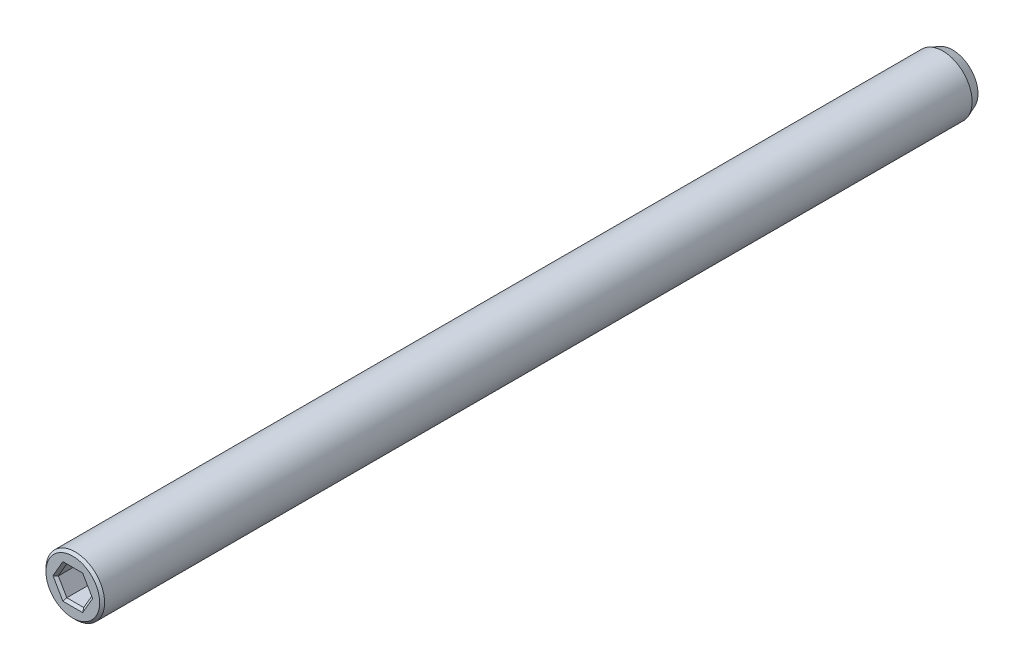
ISO-10303-21;
HEADER;
FILE_DESCRIPTION(('STEP AP214'),'2;1');
FILE_NAME('part.step','',(''),(''),'','','');
FILE_SCHEMA(('AUTOMOTIVE_DESIGN { 1 0 10303 214 1 1 1 1 }'));
ENDSEC;
DATA;
#1=APPLICATION_CONTEXT('core data for automotive mechanical design processes');
#2=APPLICATION_PROTOCOL_DEFINITION('international standard','automotive_design',2000,#1);
#3=PRODUCT_CONTEXT('',#1,'mechanical');
#4=PRODUCT('Part','Part','',(#3));
#5=PRODUCT_RELATED_PRODUCT_CATEGORY('part','',(#4));
#6=PRODUCT_DEFINITION_FORMATION('','',#4);
#7=PRODUCT_DEFINITION_CONTEXT('part definition',#1,'design');
#8=PRODUCT_DEFINITION('design','',#6,#7);
#9=PRODUCT_DEFINITION_SHAPE('','',#8);
#10=(LENGTH_UNIT() NAMED_UNIT(*) SI_UNIT(.MILLI.,.METRE.));
#11=(NAMED_UNIT(*) PLANE_ANGLE_UNIT() SI_UNIT($,.RADIAN.));
#12=(NAMED_UNIT(*) SI_UNIT($,.STERADIAN.) SOLID_ANGLE_UNIT());
#13=UNCERTAINTY_MEASURE_WITH_UNIT(LENGTH_MEASURE(1.E-05),#10,'distance_accuracy_value','');
#14=(GEOMETRIC_REPRESENTATION_CONTEXT(3) GLOBAL_UNCERTAINTY_ASSIGNED_CONTEXT((#13)) GLOBAL_UNIT_ASSIGNED_CONTEXT((#10,
#11,#12)) REPRESENTATION_CONTEXT('',''));
#15=CARTESIAN_POINT('',(0.,0.,0.));
#16=DIRECTION('',(0.,0.,1.));
#17=DIRECTION('',(1.,0.,0.));
#18=AXIS2_PLACEMENT_3D('',#15,#16,#17);
#19=CARTESIAN_POINT('',(0.,0.,-45.));
#20=DIRECTION('',(0.,0.,1.));
#21=DIRECTION('',(1.,0.,0.));
#22=AXIS2_PLACEMENT_3D('',#19,#20,#21);
#23=CYLINDRICAL_SURFACE('',#22,3.);
#24=CARTESIAN_POINT('',(0.,0.,-44.));
#25=DIRECTION('',(0.,0.,1.));
#26=DIRECTION('',(1.,0.,0.));
#27=AXIS2_PLACEMENT_3D('',#24,#25,#26);
#28=CIRCLE('',#27,3.);
#29=CARTESIAN_POINT('',(3.,0.,-44.));
#30=VERTEX_POINT('',#29);
#31=EDGE_CURVE('E39',#30,#30,#28,.T.);
#32=CARTESIAN_POINT('',(0.,0.,44.746));
#33=DIRECTION('',(0.,0.,1.));
#34=DIRECTION('',(1.,0.,0.));
#35=AXIS2_PLACEMENT_3D('',#32,#33,#34);
#36=CIRCLE('',#35,3.);
#37=CARTESIAN_POINT('',(3.,0.,44.746));
#38=VERTEX_POINT('',#37);
#39=EDGE_CURVE('E178',#38,#38,#36,.F.);
#40=CARTESIAN_POINT('',(3.,0.,-44.));
#41=CARTESIAN_POINT('',(3.,0.,-43.0755625));
#42=CARTESIAN_POINT('',(3.,0.,-42.151125));
#43=CARTESIAN_POINT('',(3.,0.,-40.30225));
#44=CARTESIAN_POINT('',(3.,0.,-39.3778125));
#45=CARTESIAN_POINT('',(3.,0.,-37.5289375));
#46=CARTESIAN_POINT('',(3.,0.,-36.6045));
#47=CARTESIAN_POINT('',(3.,0.,-34.755625));
#48=CARTESIAN_POINT('',(3.,0.,-33.8311875));
#49=CARTESIAN_POINT('',(3.,0.,-31.9823125));
#50=CARTESIAN_POINT('',(3.,0.,-31.057875));
#51=CARTESIAN_POINT('',(3.,0.,-29.209));
#52=CARTESIAN_POINT('',(3.,0.,-28.2845625));
#53=CARTESIAN_POINT('',(3.,0.,-26.4356875));
#54=CARTESIAN_POINT('',(3.,0.,-25.51125));
#55=CARTESIAN_POINT('',(3.,0.,-23.662375));
#56=CARTESIAN_POINT('',(3.,0.,-22.7379375));
#57=CARTESIAN_POINT('',(3.,0.,-20.8890625));
#58=CARTESIAN_POINT('',(3.,0.,-19.964625));
#59=CARTESIAN_POINT('',(3.,0.,-18.11575));
#60=CARTESIAN_POINT('',(3.,0.,-17.1913125));
#61=CARTESIAN_POINT('',(3.,0.,-15.3424375));
#62=CARTESIAN_POINT('',(3.,0.,-14.418));
#63=CARTESIAN_POINT('',(3.,0.,-12.569125));
#64=CARTESIAN_POINT('',(3.,0.,-11.6446875));
#65=CARTESIAN_POINT('',(3.,0.,-9.79581250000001));
#66=CARTESIAN_POINT('',(3.,0.,-8.87137500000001));
#67=CARTESIAN_POINT('',(3.,0.,-7.02250000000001));
#68=CARTESIAN_POINT('',(3.,0.,-6.09806250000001));
#69=CARTESIAN_POINT('',(3.,0.,-4.24918750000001));
#70=CARTESIAN_POINT('',(3.,0.,-3.32475000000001));
#71=CARTESIAN_POINT('',(3.,0.,-1.47587500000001));
#72=CARTESIAN_POINT('',(3.,0.,-0.551437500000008));
#73=CARTESIAN_POINT('',(3.,0.,1.29743749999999));
#74=CARTESIAN_POINT('',(3.,0.,2.22187499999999));
#75=CARTESIAN_POINT('',(3.,0.,4.07074999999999));
#76=CARTESIAN_POINT('',(3.,0.,4.99518749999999));
#77=CARTESIAN_POINT('',(3.,0.,6.84406249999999));
#78=CARTESIAN_POINT('',(3.,0.,7.76849999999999));
#79=CARTESIAN_POINT('',(3.,0.,9.61737499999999));
#80=CARTESIAN_POINT('',(3.,0.,10.5418125));
#81=CARTESIAN_POINT('',(3.,0.,12.3906875));
#82=CARTESIAN_POINT('',(3.,0.,13.315125));
#83=CARTESIAN_POINT('',(3.,0.,15.164));
#84=CARTESIAN_POINT('',(3.,0.,16.0884375));
#85=CARTESIAN_POINT('',(3.,0.,17.9373125));
#86=CARTESIAN_POINT('',(3.,0.,18.86175));
#87=CARTESIAN_POINT('',(3.,0.,20.710625));
#88=CARTESIAN_POINT('',(3.,0.,21.6350625));
#89=CARTESIAN_POINT('',(3.,0.,23.4839375));
#90=CARTESIAN_POINT('',(3.,0.,24.408375));
#91=CARTESIAN_POINT('',(3.,0.,26.25725));
#92=CARTESIAN_POINT('',(3.,0.,27.1816875));
#93=CARTESIAN_POINT('',(3.,0.,29.0305625));
#94=CARTESIAN_POINT('',(3.,0.,29.955));
#95=CARTESIAN_POINT('',(3.,0.,31.803875));
#96=CARTESIAN_POINT('',(3.,0.,32.7283125));
#97=CARTESIAN_POINT('',(3.,0.,34.5771875));
#98=CARTESIAN_POINT('',(3.,0.,35.501625));
#99=CARTESIAN_POINT('',(3.,0.,37.3505));
#100=CARTESIAN_POINT('',(3.,0.,38.2749375));
#101=CARTESIAN_POINT('',(3.,0.,40.1238125));
#102=CARTESIAN_POINT('',(3.,0.,41.04825));
#103=CARTESIAN_POINT('',(3.,0.,42.897125));
#104=CARTESIAN_POINT('',(3.,0.,43.8215625));
#105=CARTESIAN_POINT('',(3.,0.,44.746));
#106=B_SPLINE_CURVE_WITH_KNOTS('',3,(#40,#41,#42,#43,#44,#45,#46,#47,#48,#49,#50,#51,#52,#53,
#54,#55,#56,#57,#58,#59,#60,#61,#62,#63,#64,#65,#66,#67,#68,#69,#70,#71,#72,#73,#74,#75,#76,#77,
#78,#79,#80,#81,#82,#83,#84,#85,#86,#87,#88,#89,#90,#91,#92,#93,#94,#95,#96,#97,#98,#99,#100,
#101,#102,#103,#104,#105),.UNSPECIFIED.,.F.,.F.,(4,2,2,2,2,2,2,2,2,2,2,2,2,2,2,2,2,2,2,2,2,2,2,
2,2,2,2,2,2,2,2,2,4),(0.,2.7733125,5.546625,8.3199375,11.09325,13.8665625,16.639875,19.4131875,
22.1865,24.9598125,27.733125,30.5064375,33.27975,36.0530625,38.826375,41.5996875,44.373,
47.1463125,49.919625,52.6929375,55.46625,58.2395625,61.012875,63.7861875,66.5595,69.3328125,
72.106125,74.8794375,77.65275,80.4260625,83.199375,85.9726875,88.746),.UNSPECIFIED.);
#107=EDGE_CURVE('BSEAM32',#30,#38,#106,.T.);
#108=ORIENTED_EDGE('',*,*,#31,.T.);
#109=ORIENTED_EDGE('',*,*,#39,.T.);
#110=ORIENTED_EDGE('',*,*,#107,.T.);
#111=ORIENTED_EDGE('',*,*,#107,.F.);
#112=EDGE_LOOP('',(#108,#110,#109,#111));
#113=FACE_BOUND('',#112,.T.);
#114=ADVANCED_FACE('F32',(#113),#23,.T.);
#115=CARTESIAN_POINT('',(0.,0.,-45.));
#116=DIRECTION('',(0.,0.,1.));
#117=DIRECTION('',(1.,0.,0.));
#118=AXIS2_PLACEMENT_3D('',#115,#116,#117);
#119=PLANE('',#118);
#120=CARTESIAN_POINT('',(0.,0.,-45.));
#121=DIRECTION('',(0.,0.,1.));
#122=DIRECTION('',(1.,0.,0.));
#123=AXIS2_PLACEMENT_3D('',#120,#121,#122);
#124=CIRCLE('',#123,2.6);
#125=CARTESIAN_POINT('',(2.6,0.,-45.));
#126=VERTEX_POINT('',#125);
#127=EDGE_CURVE('E11',#126,#126,#124,.F.);
#128=ORIENTED_EDGE('',*,*,#127,.T.);
#129=EDGE_LOOP('',(#128));
#130=FACE_BOUND('',#129,.T.);
#131=ADVANCED_FACE('F198',(#130),#119,.F.);
#132=CARTESIAN_POINT('',(0.,0.,45.));
#133=DIRECTION('',(0.,0.,1.));
#134=DIRECTION('',(1.,0.,0.));
#135=AXIS2_PLACEMENT_3D('',#132,#133,#134);
#136=PLANE('',#135);
#137=DIRECTION('',(1.,0.,0.));
#138=VECTOR('',#137,1.);
#139=CARTESIAN_POINT('',(0.866025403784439,1.754,45.));
#140=LINE('',#139,#138);
#141=CARTESIAN_POINT('',(-1.0126723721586,1.754,45.));
#142=VERTEX_POINT('',#141);
#143=CARTESIAN_POINT('',(1.0126723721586,1.754,45.));
#144=VERTEX_POINT('',#143);
#145=EDGE_CURVE('E166',#142,#144,#140,.T.);
#146=ORIENTED_EDGE('',*,*,#145,.T.);
#147=DIRECTION('',(0.5,-0.866025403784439,0.));
#148=VECTOR('',#147,1.);
#149=CARTESIAN_POINT('',(1.95202126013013,0.127,45.));
#150=LINE('',#149,#148);
#151=CARTESIAN_POINT('',(2.02534474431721,0.,45.));
#152=VERTEX_POINT('',#151);
#153=EDGE_CURVE('E168',#144,#152,#150,.T.);
#154=ORIENTED_EDGE('',*,*,#153,.T.);
#155=DIRECTION('',(-0.5,-0.866025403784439,0.));
#156=VECTOR('',#155,1.);
#157=CARTESIAN_POINT('',(1.08599585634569,-1.627,45.));
#158=LINE('',#157,#156);
#159=CARTESIAN_POINT('',(1.0126723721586,-1.754,45.));
#160=VERTEX_POINT('',#159);
#161=EDGE_CURVE('E158',#152,#160,#158,.T.);
#162=ORIENTED_EDGE('',*,*,#161,.T.);
#163=DIRECTION('',(-1.,0.,0.));
#164=VECTOR('',#163,1.);
#165=CARTESIAN_POINT('',(-0.866025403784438,-1.754,45.));
#166=LINE('',#165,#164);
#167=CARTESIAN_POINT('',(-1.0126723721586,-1.754,45.));
#168=VERTEX_POINT('',#167);
#169=EDGE_CURVE('E160',#160,#168,#166,.T.);
#170=ORIENTED_EDGE('',*,*,#169,.T.);
#171=DIRECTION('',(-0.5,0.866025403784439,0.));
#172=VECTOR('',#171,1.);
#173=CARTESIAN_POINT('',(-1.95202126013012,-0.127000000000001,45.));
#174=LINE('',#173,#172);
#175=CARTESIAN_POINT('',(-2.02534474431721,0.,45.));
#176=VERTEX_POINT('',#175);
#177=EDGE_CURVE('E162',#168,#176,#174,.T.);
#178=ORIENTED_EDGE('',*,*,#177,.T.);
#179=DIRECTION('',(0.5,0.866025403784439,0.));
#180=VECTOR('',#179,1.);
#181=CARTESIAN_POINT('',(-1.08599585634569,1.627,45.));
#182=LINE('',#181,#180);
#183=EDGE_CURVE('E164',#176,#142,#182,.T.);
#184=ORIENTED_EDGE('',*,*,#183,.T.);
#185=EDGE_LOOP('',(#146,#154,#162,#170,#178,#184));
#186=FACE_BOUND('',#185,.T.);
#187=CARTESIAN_POINT('',(0.,0.,45.));
#188=DIRECTION('',(0.,0.,1.));
#189=DIRECTION('',(1.,0.,0.));
#190=AXIS2_PLACEMENT_3D('',#187,#188,#189);
#191=CIRCLE('',#190,2.74599999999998);
#192=CARTESIAN_POINT('',(2.74599999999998,0.,45.));
#193=VERTEX_POINT('',#192);
#194=EDGE_CURVE('E155',#193,#193,#191,.T.);
#195=ORIENTED_EDGE('',*,*,#194,.T.);
#196=EDGE_LOOP('',(#195));
#197=FACE_BOUND('',#196,.T.);
#198=ADVANCED_FACE('F202',(#186,#197),#136,.T.);
#199=CARTESIAN_POINT('',(0.866025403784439,-1.5,42.));
#200=DIRECTION('',(0.866025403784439,-0.5,0.));
#201=DIRECTION('',(0.5,0.866025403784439,0.));
#202=AXIS2_PLACEMENT_3D('',#199,#200,#201);
#203=PLANE('',#202);
#204=DIRECTION('',(0.,0.,1.));
#205=VECTOR('',#204,1.);
#206=CARTESIAN_POINT('',(0.866025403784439,-1.5,42.));
#207=LINE('',#206,#205);
#208=CARTESIAN_POINT('',(0.866025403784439,-1.5,42.));
#209=VERTEX_POINT('',#208);
#210=CARTESIAN_POINT('',(0.866025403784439,-1.5,44.746));
#211=VERTEX_POINT('',#210);
#212=EDGE_CURVE('E143',#209,#211,#207,.T.);
#213=ORIENTED_EDGE('',*,*,#212,.T.);
#214=DIRECTION('',(0.5,0.866025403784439,0.));
#215=VECTOR('',#214,1.);
#216=CARTESIAN_POINT('',(1.73205080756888,0.,44.746));
#217=LINE('',#216,#215);
#218=CARTESIAN_POINT('',(1.73205080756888,0.,44.746));
#219=VERTEX_POINT('',#218);
#220=EDGE_CURVE('E110',#211,#219,#217,.T.);
#221=ORIENTED_EDGE('',*,*,#220,.T.);
#222=DIRECTION('',(0.,0.,1.));
#223=VECTOR('',#222,1.);
#224=CARTESIAN_POINT('',(1.73205080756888,0.,42.));
#225=LINE('',#224,#223);
#226=CARTESIAN_POINT('',(1.73205080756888,0.,42.));
#227=VERTEX_POINT('',#226);
#228=EDGE_CURVE('E103',#227,#219,#225,.T.);
#229=ORIENTED_EDGE('',*,*,#228,.F.);
#230=DIRECTION('',(0.5,0.866025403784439,0.));
#231=VECTOR('',#230,1.);
#232=CARTESIAN_POINT('',(0.866025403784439,-1.5,42.));
#233=LINE('',#232,#231);
#234=EDGE_CURVE('E107',#209,#227,#233,.T.);
#235=ORIENTED_EDGE('',*,*,#234,.F.);
#236=EDGE_LOOP('',(#213,#221,#229,#235));
#237=FACE_BOUND('',#236,.T.);
#238=ADVANCED_FACE('F105',(#237),#203,.F.);
#239=CARTESIAN_POINT('',(-0.866025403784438,-1.5,42.));
#240=DIRECTION('',(0.,-1.,0.));
#241=DIRECTION('',(0.,0.,-1.));
#242=AXIS2_PLACEMENT_3D('',#239,#240,#241);
#243=PLANE('',#242);
#244=DIRECTION('',(0.,0.,1.));
#245=VECTOR('',#244,1.);
#246=CARTESIAN_POINT('',(-0.866025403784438,-1.5,42.));
#247=LINE('',#246,#245);
#248=CARTESIAN_POINT('',(-0.866025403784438,-1.5,42.));
#249=VERTEX_POINT('',#248);
#250=CARTESIAN_POINT('',(-0.866025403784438,-1.5,44.746));
#251=VERTEX_POINT('',#250);
#252=EDGE_CURVE('E146',#249,#251,#247,.T.);
#253=ORIENTED_EDGE('',*,*,#252,.T.);
#254=DIRECTION('',(1.,0.,0.));
#255=VECTOR('',#254,1.);
#256=CARTESIAN_POINT('',(0.866025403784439,-1.5,44.746));
#257=LINE('',#256,#255);
#258=EDGE_CURVE('E46',#251,#211,#257,.T.);
#259=ORIENTED_EDGE('',*,*,#258,.T.);
#260=ORIENTED_EDGE('',*,*,#212,.F.);
#261=DIRECTION('',(1.,0.,0.));
#262=VECTOR('',#261,1.);
#263=CARTESIAN_POINT('',(-0.866025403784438,-1.5,42.));
#264=LINE('',#263,#262);
#265=EDGE_CURVE('E115',#249,#209,#264,.T.);
#266=ORIENTED_EDGE('',*,*,#265,.F.);
#267=EDGE_LOOP('',(#253,#259,#260,#266));
#268=FACE_BOUND('',#267,.T.);
#269=ADVANCED_FACE('F212',(#268),#243,.F.);
#270=CARTESIAN_POINT('',(-1.73205080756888,0.,42.));
#271=DIRECTION('',(-0.866025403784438,-0.5,0.));
#272=DIRECTION('',(0.5,-0.866025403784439,0.));
#273=AXIS2_PLACEMENT_3D('',#270,#271,#272);
#274=PLANE('',#273);
#275=DIRECTION('',(0.,0.,1.));
#276=VECTOR('',#275,1.);
#277=CARTESIAN_POINT('',(-1.73205080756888,0.,42.));
#278=LINE('',#277,#276);
#279=CARTESIAN_POINT('',(-1.73205080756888,0.,42.));
#280=VERTEX_POINT('',#279);
#281=CARTESIAN_POINT('',(-1.73205080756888,0.,44.746));
#282=VERTEX_POINT('',#281);
#283=EDGE_CURVE('E148',#280,#282,#278,.T.);
#284=ORIENTED_EDGE('',*,*,#283,.T.);
#285=DIRECTION('',(0.5,-0.866025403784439,0.));
#286=VECTOR('',#285,1.);
#287=CARTESIAN_POINT('',(-0.866025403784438,-1.5,44.746));
#288=LINE('',#287,#286);
#289=EDGE_CURVE('E54',#282,#251,#288,.T.);
#290=ORIENTED_EDGE('',*,*,#289,.T.);
#291=ORIENTED_EDGE('',*,*,#252,.F.);
#292=DIRECTION('',(0.5,-0.866025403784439,0.));
#293=VECTOR('',#292,1.);
#294=CARTESIAN_POINT('',(-1.73205080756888,0.,42.));
#295=LINE('',#294,#293);
#296=EDGE_CURVE('E140',#280,#249,#295,.T.);
#297=ORIENTED_EDGE('',*,*,#296,.F.);
#298=EDGE_LOOP('',(#284,#290,#291,#297));
#299=FACE_BOUND('',#298,.T.);
#300=ADVANCED_FACE('F222',(#299),#274,.F.);
#301=CARTESIAN_POINT('',(-0.866025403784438,1.5,42.));
#302=DIRECTION('',(-0.866025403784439,0.5,0.));
#303=DIRECTION('',(-0.5,-0.866025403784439,0.));
#304=AXIS2_PLACEMENT_3D('',#301,#302,#303);
#305=PLANE('',#304);
#306=DIRECTION('',(0.,0.,1.));
#307=VECTOR('',#306,1.);
#308=CARTESIAN_POINT('',(-0.866025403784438,1.5,42.));
#309=LINE('',#308,#307);
#310=CARTESIAN_POINT('',(-0.866025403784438,1.5,42.));
#311=VERTEX_POINT('',#310);
#312=CARTESIAN_POINT('',(-0.866025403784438,1.5,44.746));
#313=VERTEX_POINT('',#312);
#314=EDGE_CURVE('E150',#311,#313,#309,.T.);
#315=ORIENTED_EDGE('',*,*,#314,.T.);
#316=DIRECTION('',(-0.5,-0.866025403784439,0.));
#317=VECTOR('',#316,1.);
#318=CARTESIAN_POINT('',(-1.73205080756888,0.,44.746));
#319=LINE('',#318,#317);
#320=EDGE_CURVE('E173',#313,#282,#319,.T.);
#321=ORIENTED_EDGE('',*,*,#320,.T.);
#322=ORIENTED_EDGE('',*,*,#283,.F.);
#323=DIRECTION('',(-0.5,-0.866025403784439,0.));
#324=VECTOR('',#323,1.);
#325=CARTESIAN_POINT('',(-0.866025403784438,1.5,42.));
#326=LINE('',#325,#324);
#327=EDGE_CURVE('E137',#311,#280,#326,.T.);
#328=ORIENTED_EDGE('',*,*,#327,.F.);
#329=EDGE_LOOP('',(#315,#321,#322,#328));
#330=FACE_BOUND('',#329,.T.);
#331=ADVANCED_FACE('F218',(#330),#305,.F.);
#332=CARTESIAN_POINT('',(0.866025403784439,1.5,42.));
#333=DIRECTION('',(0.,1.,0.));
#334=DIRECTION('',(0.,0.,1.));
#335=AXIS2_PLACEMENT_3D('',#332,#333,#334);
#336=PLANE('',#335);
#337=DIRECTION('',(0.,0.,1.));
#338=VECTOR('',#337,1.);
#339=CARTESIAN_POINT('',(0.866025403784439,1.5,42.));
#340=LINE('',#339,#338);
#341=CARTESIAN_POINT('',(0.866025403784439,1.5,42.));
#342=VERTEX_POINT('',#341);
#343=CARTESIAN_POINT('',(0.866025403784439,1.5,44.746));
#344=VERTEX_POINT('',#343);
#345=EDGE_CURVE('E114',#342,#344,#340,.T.);
#346=ORIENTED_EDGE('',*,*,#345,.T.);
#347=DIRECTION('',(-1.,0.,0.));
#348=VECTOR('',#347,1.);
#349=CARTESIAN_POINT('',(-0.866025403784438,1.5,44.746));
#350=LINE('',#349,#348);
#351=EDGE_CURVE('E171',#344,#313,#350,.T.);
#352=ORIENTED_EDGE('',*,*,#351,.T.);
#353=ORIENTED_EDGE('',*,*,#314,.F.);
#354=DIRECTION('',(-1.,0.,0.));
#355=VECTOR('',#354,1.);
#356=CARTESIAN_POINT('',(0.866025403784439,1.5,42.));
#357=LINE('',#356,#355);
#358=EDGE_CURVE('E124',#342,#311,#357,.T.);
#359=ORIENTED_EDGE('',*,*,#358,.F.);
#360=EDGE_LOOP('',(#346,#352,#353,#359));
#361=FACE_BOUND('',#360,.T.);
#362=ADVANCED_FACE('F215',(#361),#336,.F.);
#363=CARTESIAN_POINT('',(1.73205080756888,0.,42.));
#364=DIRECTION('',(0.866025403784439,0.5,0.));
#365=DIRECTION('',(-0.5,0.866025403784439,0.));
#366=AXIS2_PLACEMENT_3D('',#363,#364,#365);
#367=PLANE('',#366);
#368=ORIENTED_EDGE('',*,*,#228,.T.);
#369=DIRECTION('',(-0.5,0.866025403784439,0.));
#370=VECTOR('',#369,1.);
#371=CARTESIAN_POINT('',(0.866025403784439,1.5,44.746));
#372=LINE('',#371,#370);
#373=EDGE_CURVE('E145',#219,#344,#372,.T.);
#374=ORIENTED_EDGE('',*,*,#373,.T.);
#375=ORIENTED_EDGE('',*,*,#345,.F.);
#376=DIRECTION('',(-0.5,0.866025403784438,0.));
#377=VECTOR('',#376,1.);
#378=CARTESIAN_POINT('',(1.73205080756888,0.,42.));
#379=LINE('',#378,#377);
#380=EDGE_CURVE('E118',#227,#342,#379,.T.);
#381=ORIENTED_EDGE('',*,*,#380,.F.);
#382=EDGE_LOOP('',(#368,#374,#375,#381));
#383=FACE_BOUND('',#382,.T.);
#384=ADVANCED_FACE('F119',(#383),#367,.F.);
#385=CARTESIAN_POINT('',(2.59807621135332,1.5,42.));
#386=DIRECTION('',(0.,0.,1.));
#387=DIRECTION('',(1.,0.,0.));
#388=AXIS2_PLACEMENT_3D('',#385,#386,#387);
#389=PLANE('',#388);
#390=ORIENTED_EDGE('',*,*,#234,.T.);
#391=ORIENTED_EDGE('',*,*,#380,.T.);
#392=ORIENTED_EDGE('',*,*,#358,.T.);
#393=ORIENTED_EDGE('',*,*,#327,.T.);
#394=ORIENTED_EDGE('',*,*,#296,.T.);
#395=ORIENTED_EDGE('',*,*,#265,.T.);
#396=EDGE_LOOP('',(#390,#391,#392,#393,#394,#395));
#397=FACE_BOUND('',#396,.T.);
#398=ADVANCED_FACE('F126',(#397),#389,.T.);
#399=CARTESIAN_POINT('',(-1.73205080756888,0.,44.746));
#400=DIRECTION('',(0.612372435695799,0.353553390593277,0.707106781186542));
#401=DIRECTION('',(0.75592894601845,0.,-0.654653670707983));
#402=AXIS2_PLACEMENT_3D('',#399,#400,#401);
#403=PLANE('',#402);
#404=DIRECTION('',(-0.755928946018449,0.,0.654653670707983));
#405=VECTOR('',#404,1.);
#406=CARTESIAN_POINT('',(-1.23717914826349,0.,44.3174285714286));
#407=LINE('',#406,#405);
#408=EDGE_CURVE('E132',#176,#282,#407,.F.);
#409=ORIENTED_EDGE('',*,*,#408,.F.);
#410=ORIENTED_EDGE('',*,*,#177,.F.);
#411=DIRECTION('',(-0.377964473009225,-0.654653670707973,0.654653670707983));
#412=VECTOR('',#411,1.);
#413=CARTESIAN_POINT('',(-0.618589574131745,-1.07142857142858,44.3174285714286));
#414=LINE('',#413,#412);
#415=EDGE_CURVE('E129',#251,#168,#414,.T.);
#416=ORIENTED_EDGE('',*,*,#415,.F.);
#417=ORIENTED_EDGE('',*,*,#289,.F.);
#418=EDGE_LOOP('',(#409,#410,#416,#417));
#419=FACE_BOUND('',#418,.T.);
#420=ADVANCED_FACE('F230',(#419),#403,.T.);
#421=CARTESIAN_POINT('',(-0.866025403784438,-1.5,44.746));
#422=DIRECTION('',(0.,0.707106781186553,0.707106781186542));
#423=DIRECTION('',(0.,-0.707106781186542,0.707106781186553));
#424=AXIS2_PLACEMENT_3D('',#421,#422,#423);
#425=PLANE('',#424);
#426=ORIENTED_EDGE('',*,*,#415,.T.);
#427=ORIENTED_EDGE('',*,*,#169,.F.);
#428=DIRECTION('',(0.377964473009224,-0.654653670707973,0.654653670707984));
#429=VECTOR('',#428,1.);
#430=CARTESIAN_POINT('',(0.618589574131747,-1.07142857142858,44.3174285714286));
#431=LINE('',#430,#429);
#432=EDGE_CURVE('E264',#211,#160,#431,.T.);
#433=ORIENTED_EDGE('',*,*,#432,.F.);
#434=ORIENTED_EDGE('',*,*,#258,.F.);
#435=EDGE_LOOP('',(#426,#427,#433,#434));
#436=FACE_BOUND('',#435,.T.);
#437=ADVANCED_FACE('F233',(#436),#425,.T.);
#438=CARTESIAN_POINT('',(-0.866025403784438,1.5,44.746));
#439=DIRECTION('',(0.6123724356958,-0.353553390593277,0.707106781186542));
#440=DIRECTION('',(0.755928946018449,0.,-0.654653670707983));
#441=AXIS2_PLACEMENT_3D('',#438,#439,#440);
#442=PLANE('',#441);
#443=ORIENTED_EDGE('',*,*,#408,.T.);
#444=ORIENTED_EDGE('',*,*,#320,.F.);
#445=DIRECTION('',(-0.377964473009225,0.654653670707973,0.654653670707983));
#446=VECTOR('',#445,1.);
#447=CARTESIAN_POINT('',(-0.618589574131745,1.07142857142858,44.3174285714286));
#448=LINE('',#447,#446);
#449=EDGE_CURVE('E259',#142,#313,#448,.F.);
#450=ORIENTED_EDGE('',*,*,#449,.F.);
#451=ORIENTED_EDGE('',*,*,#183,.F.);
#452=EDGE_LOOP('',(#443,#444,#450,#451));
#453=FACE_BOUND('',#452,.T.);
#454=ADVANCED_FACE('F237',(#453),#442,.T.);
#455=CARTESIAN_POINT('',(0.866025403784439,-1.5,44.746));
#456=DIRECTION('',(-0.6123724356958,0.353553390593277,0.707106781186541));
#457=DIRECTION('',(0.755928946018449,0.,0.654653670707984));
#458=AXIS2_PLACEMENT_3D('',#455,#456,#457);
#459=PLANE('',#458);
#460=ORIENTED_EDGE('',*,*,#432,.T.);
#461=ORIENTED_EDGE('',*,*,#161,.F.);
#462=DIRECTION('',(-0.755928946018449,0.,-0.654653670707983));
#463=VECTOR('',#462,1.);
#464=CARTESIAN_POINT('',(1.73205080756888,0.,44.746));
#465=LINE('',#464,#463);
#466=EDGE_CURVE('E256',#219,#152,#465,.F.);
#467=ORIENTED_EDGE('',*,*,#466,.F.);
#468=ORIENTED_EDGE('',*,*,#220,.F.);
#469=EDGE_LOOP('',(#460,#461,#467,#468));
#470=FACE_BOUND('',#469,.T.);
#471=ADVANCED_FACE('F241',(#470),#459,.T.);
#472=CARTESIAN_POINT('',(0.866025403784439,1.5,44.746));
#473=DIRECTION('',(0.,-0.707106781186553,0.707106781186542));
#474=DIRECTION('',(0.,-0.707106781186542,-0.707106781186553));
#475=AXIS2_PLACEMENT_3D('',#472,#473,#474);
#476=PLANE('',#475);
#477=ORIENTED_EDGE('',*,*,#449,.T.);
#478=ORIENTED_EDGE('',*,*,#351,.F.);
#479=DIRECTION('',(0.377964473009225,0.654653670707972,0.654653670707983));
#480=VECTOR('',#479,1.);
#481=CARTESIAN_POINT('',(0.618589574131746,1.07142857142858,44.3174285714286));
#482=LINE('',#481,#480);
#483=EDGE_CURVE('E260',#144,#344,#482,.F.);
#484=ORIENTED_EDGE('',*,*,#483,.F.);
#485=ORIENTED_EDGE('',*,*,#145,.F.);
#486=EDGE_LOOP('',(#477,#478,#484,#485));
#487=FACE_BOUND('',#486,.T.);
#488=ADVANCED_FACE('F245',(#487),#476,.T.);
#489=CARTESIAN_POINT('',(1.73205080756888,0.,44.746));
#490=DIRECTION('',(-0.612372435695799,-0.353553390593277,0.707106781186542));
#491=DIRECTION('',(0.75592894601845,0.,0.654653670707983));
#492=AXIS2_PLACEMENT_3D('',#489,#490,#491);
#493=PLANE('',#492);
#494=ORIENTED_EDGE('',*,*,#466,.T.);
#495=ORIENTED_EDGE('',*,*,#153,.F.);
#496=ORIENTED_EDGE('',*,*,#483,.T.);
#497=ORIENTED_EDGE('',*,*,#373,.F.);
#498=EDGE_LOOP('',(#494,#495,#496,#497));
#499=FACE_BOUND('',#498,.T.);
#500=ADVANCED_FACE('F193',(#499),#493,.T.);
#501=CARTESIAN_POINT('',(0.,0.,45.));
#502=DIRECTION('',(0.,0.,-1.));
#503=DIRECTION('',(-1.,0.,0.));
#504=AXIS2_PLACEMENT_3D('',#501,#502,#503);
#505=CONICAL_SURFACE('',#504,2.74599999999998,0.785398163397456);
#506=ORIENTED_EDGE('',*,*,#39,.F.);
#507=EDGE_LOOP('',(#506));
#508=FACE_BOUND('',#507,.T.);
#509=ORIENTED_EDGE('',*,*,#194,.F.);
#510=EDGE_LOOP('',(#509));
#511=FACE_BOUND('',#510,.T.);
#512=ADVANCED_FACE('F187',(#508,#511),#505,.T.);
#513=CARTESIAN_POINT('',(0.,0.,-44.));
#514=DIRECTION('',(0.,0.,1.));
#515=DIRECTION('',(1.,0.,0.));
#516=AXIS2_PLACEMENT_3D('',#513,#514,#515);
#517=CONICAL_SURFACE('',#516,3.,0.380506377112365);
#518=ORIENTED_EDGE('',*,*,#127,.F.);
#519=EDGE_LOOP('',(#518));
#520=FACE_BOUND('',#519,.T.);
#521=ORIENTED_EDGE('',*,*,#31,.F.);
#522=EDGE_LOOP('',(#521));
#523=FACE_BOUND('',#522,.T.);
#524=ADVANCED_FACE('F185',(#520,#523),#517,.T.);
#525=CLOSED_SHELL('',(#114,#131,#198,#238,#269,#300,#331,#362,#384,#398,#420,#437,#454,#471,
#488,#500,#512,#524));
#526=MANIFOLD_SOLID_BREP('B2',#525);
#527=ADVANCED_BREP_SHAPE_REPRESENTATION('',(#18,#526),#14);
#528=SHAPE_DEFINITION_REPRESENTATION(#9,#527);
ENDSEC;
END-ISO-10303-21;
